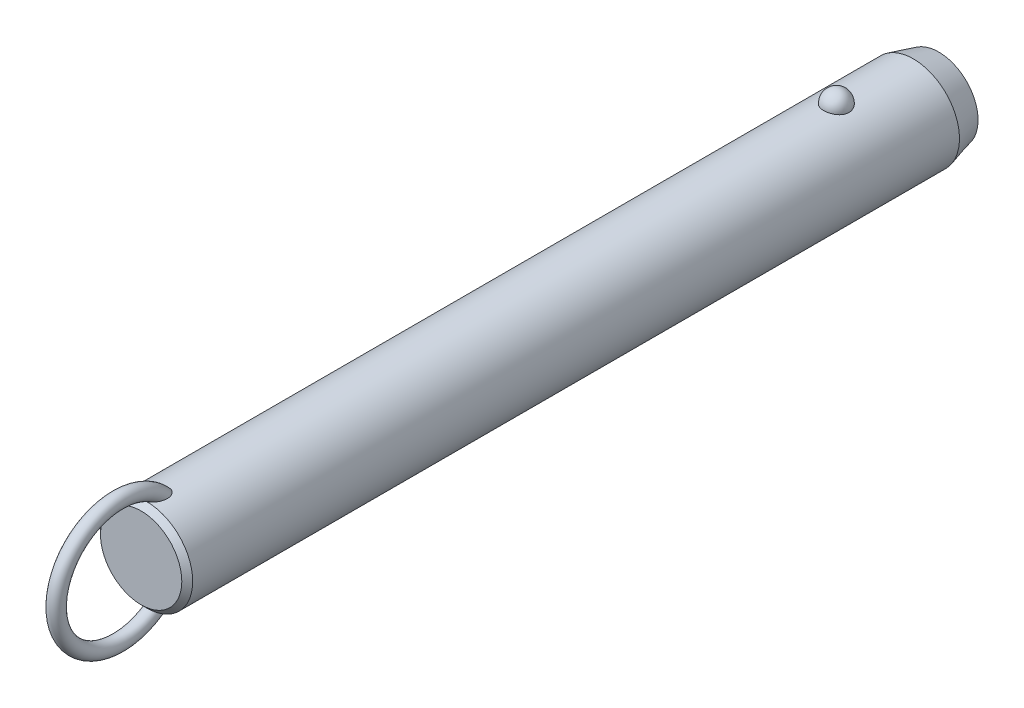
ISO-10303-21;
HEADER;
FILE_DESCRIPTION(('STEP AP214'),'2;1');
FILE_NAME('part.step','',(''),(''),'','','');
FILE_SCHEMA(('AUTOMOTIVE_DESIGN { 1 0 10303 214 1 1 1 1 }'));
ENDSEC;
DATA;
#1=APPLICATION_CONTEXT('core data for automotive mechanical design processes');
#2=APPLICATION_PROTOCOL_DEFINITION('international standard','automotive_design',2000,#1);
#3=PRODUCT_CONTEXT('',#1,'mechanical');
#4=PRODUCT('Part','Part','',(#3));
#5=PRODUCT_RELATED_PRODUCT_CATEGORY('part','',(#4));
#6=PRODUCT_DEFINITION_FORMATION('','',#4);
#7=PRODUCT_DEFINITION_CONTEXT('part definition',#1,'design');
#8=PRODUCT_DEFINITION('design','',#6,#7);
#9=PRODUCT_DEFINITION_SHAPE('','',#8);
#10=(LENGTH_UNIT() NAMED_UNIT(*) SI_UNIT(.MILLI.,.METRE.));
#11=(NAMED_UNIT(*) PLANE_ANGLE_UNIT() SI_UNIT($,.RADIAN.));
#12=(NAMED_UNIT(*) SI_UNIT($,.STERADIAN.) SOLID_ANGLE_UNIT());
#13=UNCERTAINTY_MEASURE_WITH_UNIT(LENGTH_MEASURE(1.E-05),#10,'distance_accuracy_value','');
#14=(GEOMETRIC_REPRESENTATION_CONTEXT(3) GLOBAL_UNCERTAINTY_ASSIGNED_CONTEXT((#13)) GLOBAL_UNIT_ASSIGNED_CONTEXT((#10,
#11,#12)) REPRESENTATION_CONTEXT('',''));
#15=CARTESIAN_POINT('',(0.,0.,0.));
#16=DIRECTION('',(0.,0.,1.));
#17=DIRECTION('',(1.,0.,0.));
#18=AXIS2_PLACEMENT_3D('',#15,#16,#17);
#19=CARTESIAN_POINT('',(0.,0.,175.3));
#20=DIRECTION('',(0.,0.,-1.));
#21=DIRECTION('',(-1.,0.,0.));
#22=AXIS2_PLACEMENT_3D('',#19,#20,#21);
#23=CYLINDRICAL_SURFACE('',#22,12.7);
#24=CARTESIAN_POINT('',(3.46661256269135,12.2177165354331,-3.50000000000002));
#25=CARTESIAN_POINT('',(3.4666090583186,12.2177194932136,-3.30432790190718));
#26=CARTESIAN_POINT('',(3.45063567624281,12.2222841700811,-3.10861112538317));
#27=CARTESIAN_POINT('',(3.38712451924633,12.2400345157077,-2.72271899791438));
#28=CARTESIAN_POINT('',(3.33957415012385,12.2532236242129,-2.53254588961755));
#29=CARTESIAN_POINT('',(3.2141234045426,12.286724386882,-2.16324948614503));
#30=CARTESIAN_POINT('',(3.13623639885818,12.3070329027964,-1.98412136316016));
#31=CARTESIAN_POINT('',(2.95205930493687,12.3525018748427,-1.6418059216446));
#32=CARTESIAN_POINT('',(2.84577003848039,12.3776621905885,-1.47861814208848));
#33=CARTESIAN_POINT('',(2.60688050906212,12.4301712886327,-1.17190583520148));
#34=CARTESIAN_POINT('',(2.47415697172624,12.4575299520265,-1.0284789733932));
#35=CARTESIAN_POINT('',(2.18615174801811,12.5112810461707,-0.766177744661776));
#36=CARTESIAN_POINT('',(2.03087002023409,12.5376734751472,-0.647303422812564));
#37=CARTESIAN_POINT('',(1.70237334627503,12.5864761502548,-0.437732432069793));
#38=CARTESIAN_POINT('',(1.52920948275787,12.6088972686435,-0.346958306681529));
#39=CARTESIAN_POINT('',(1.16944170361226,12.6473352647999,-0.195750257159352));
#40=CARTESIAN_POINT('',(0.982839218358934,12.663352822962,-0.135313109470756));
#41=CARTESIAN_POINT('',(0.604961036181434,12.6869706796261,-0.0473241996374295));
#42=CARTESIAN_POINT('',(0.41382314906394,12.6947125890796,-0.0192185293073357));
#43=CARTESIAN_POINT('',(0.0293827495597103,12.7014203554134,0.00517254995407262));
#44=CARTESIAN_POINT('',(-0.163919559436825,12.7003870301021,0.00146092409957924));
#45=CARTESIAN_POINT('',(-0.544374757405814,12.689735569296,-0.0373939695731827));
#46=CARTESIAN_POINT('',(-0.731575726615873,12.6802364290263,-0.0721015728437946));
#47=CARTESIAN_POINT('',(-1.09733277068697,12.6538333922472,-0.171364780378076));
#48=CARTESIAN_POINT('',(-1.27588869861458,12.6369293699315,-0.235920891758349));
#49=CARTESIAN_POINT('',(-1.6204698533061,12.5973946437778,-0.393548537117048));
#50=CARTESIAN_POINT('',(-1.78641865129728,12.5747321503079,-0.486778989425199));
#51=CARTESIAN_POINT('',(-2.10030671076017,12.5261316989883,-0.699110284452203));
#52=CARTESIAN_POINT('',(-2.24824419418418,12.5001934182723,-0.818213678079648));
#53=CARTESIAN_POINT('',(-2.52491489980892,12.4472906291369,-1.0815712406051));
#54=CARTESIAN_POINT('',(-2.65324222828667,12.4203160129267,-1.22624992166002));
#55=CARTESIAN_POINT('',(-2.88410007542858,12.3687509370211,-1.53528325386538));
#56=CARTESIAN_POINT('',(-2.98662883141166,12.3441606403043,-1.69963924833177));
#57=CARTESIAN_POINT('',(-3.16432417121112,12.2998199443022,-2.04548497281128));
#58=CARTESIAN_POINT('',(-3.23917525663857,12.2801261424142,-2.22714424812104));
#59=CARTESIAN_POINT('',(-3.35800573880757,12.248167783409,-2.60091389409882));
#60=CARTESIAN_POINT('',(-3.4019860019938,12.2359030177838,-2.79302397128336));
#61=CARTESIAN_POINT('',(-3.45784812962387,12.2202347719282,-3.18140279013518));
#62=CARTESIAN_POINT('',(-3.46986123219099,12.2167950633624,-3.37765118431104));
#63=CARTESIAN_POINT('',(-3.46186273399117,12.2190638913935,-3.76943689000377));
#64=CARTESIAN_POINT('',(-3.44185196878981,12.2247721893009,-3.96497421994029));
#65=CARTESIAN_POINT('',(-3.37048652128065,12.2446381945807,-4.34881728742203));
#66=CARTESIAN_POINT('',(-3.31928253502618,12.2587552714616,-4.53715319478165));
#67=CARTESIAN_POINT('',(-3.18693461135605,12.2938237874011,-4.9023172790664));
#68=CARTESIAN_POINT('',(-3.1057895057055,12.3147754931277,-5.07914500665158));
#69=CARTESIAN_POINT('',(-2.91506431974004,12.3613125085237,-5.41732059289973));
#70=CARTESIAN_POINT('',(-2.80533587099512,12.3869217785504,-5.57858147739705));
#71=CARTESIAN_POINT('',(-2.560414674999,12.4398525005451,-5.88013283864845));
#72=CARTESIAN_POINT('',(-2.42522099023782,12.4671740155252,-6.02042254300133));
#73=CARTESIAN_POINT('',(-2.1323357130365,12.5205965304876,-6.27662798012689));
#74=CARTESIAN_POINT('',(-1.97456596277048,12.5466928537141,-6.39245542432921));
#75=CARTESIAN_POINT('',(-1.64115839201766,12.5946384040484,-6.59583547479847));
#76=CARTESIAN_POINT('',(-1.46552179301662,12.6164879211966,-6.68339001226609));
#77=CARTESIAN_POINT('',(-1.10356050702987,12.6532533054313,-6.82682153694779));
#78=CARTESIAN_POINT('',(-0.9173913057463,12.6682500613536,-6.88306988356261));
#79=CARTESIAN_POINT('',(-0.537836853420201,12.6900288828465,-6.96386887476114));
#80=CARTESIAN_POINT('',(-0.344452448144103,12.6968119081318,-6.98842322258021));
#81=CARTESIAN_POINT('',(0.0402577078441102,12.7013667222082,-7.00496469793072));
#82=CARTESIAN_POINT('',(0.231556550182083,12.6993008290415,-6.99753844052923));
#83=CARTESIAN_POINT('',(0.610105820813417,12.6867505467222,-6.95166366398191));
#84=CARTESIAN_POINT('',(0.797356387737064,12.6762664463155,-6.91321620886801));
#85=CARTESIAN_POINT('',(1.16186657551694,12.6480587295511,-6.80658431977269));
#86=CARTESIAN_POINT('',(1.33915951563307,12.6303611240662,-6.73850666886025));
#87=CARTESIAN_POINT('',(1.67968518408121,12.5896027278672,-6.57450875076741));
#88=CARTESIAN_POINT('',(1.84291705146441,12.5665416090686,-6.47858678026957));
#89=CARTESIAN_POINT('',(2.15340192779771,12.5171072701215,-6.25982455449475));
#90=CARTESIAN_POINT('',(2.30037831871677,12.4906895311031,-6.13660186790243));
#91=CARTESIAN_POINT('',(2.5717412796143,12.4376567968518,-5.86739587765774));
#92=CARTESIAN_POINT('',(2.69612388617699,12.4110417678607,-5.72140858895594));
#93=CARTESIAN_POINT('',(2.92107785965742,12.360051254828,-5.40794137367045));
#94=CARTESIAN_POINT('',(3.02121329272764,12.3357209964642,-5.24014110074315));
#95=CARTESIAN_POINT('',(3.19236291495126,12.2925446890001,-4.88969865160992));
#96=CARTESIAN_POINT('',(3.26338839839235,12.2736965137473,-4.70706226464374));
#97=CARTESIAN_POINT('',(3.36788038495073,12.245404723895,-4.35469510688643));
#98=CARTESIAN_POINT('',(3.40484026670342,12.2351018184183,-4.18605935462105));
#99=CARTESIAN_POINT('',(3.45420764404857,12.2212564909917,-3.84496058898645));
#100=CARTESIAN_POINT('',(3.46661565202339,12.2177139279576,-3.67249765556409));
#101=CARTESIAN_POINT('',(3.46661256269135,12.2177165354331,-3.50000000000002));
#102=B_SPLINE_CURVE_WITH_KNOTS('',3,(#24,#25,#26,#27,#28,#29,#30,#31,#32,#33,#34,#35,#36,#37,
#38,#39,#40,#41,#42,#43,#44,#45,#46,#47,#48,#49,#50,#51,#52,#53,#54,#55,#56,#57,#58,#59,#60,#61,
#62,#63,#64,#65,#66,#67,#68,#69,#70,#71,#72,#73,#74,#75,#76,#77,#78,#79,#80,#81,#82,#83,#84,#85,
#86,#87,#88,#89,#90,#91,#92,#93,#94,#95,#96,#97,#98,#99,#100,#101),.UNSPECIFIED.,.T.,.F.,(4,2,2,
2,2,2,2,2,2,2,2,2,2,2,2,2,2,2,2,2,2,2,2,2,2,2,2,2,2,2,2,2,2,2,2,2,2,2,4),(0.,0.586396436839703,
1.17302689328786,1.7593990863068,2.34575431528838,2.93491084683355,3.52406845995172,
4.11158733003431,4.69904375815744,5.2762784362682,5.85345931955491,6.42265312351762,
6.99185659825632,7.56427334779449,8.136746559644,8.71981013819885,9.3029135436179,
9.89247258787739,10.4820150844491,11.0691335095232,11.6562366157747,12.2405256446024,
12.8248374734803,13.412244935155,13.9996740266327,14.5891883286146,15.1786623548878,
15.7609861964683,16.3432419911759,16.9148635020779,17.4864654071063,18.0560241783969,
18.6256177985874,19.2037609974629,19.7820055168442,20.3699810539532,20.957728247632,
21.4746855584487,21.9916320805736),.UNSPECIFIED.);
#103=CARTESIAN_POINT('',(3.46661256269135,12.2177165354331,-3.50000000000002));
#104=VERTEX_POINT('',#103);
#105=EDGE_CURVE('E41',#104,#104,#102,.T.);
#106=ORIENTED_EDGE('',*,*,#105,.T.);
#107=EDGE_LOOP('',(#106));
#108=FACE_BOUND('',#107,.T.);
#109=CARTESIAN_POINT('',(0.,0.,186.5));
#110=DIRECTION('',(0.,0.,1.));
#111=DIRECTION('',(1.,0.,0.));
#112=AXIS2_PLACEMENT_3D('',#109,#110,#111);
#113=CIRCLE('',#112,12.7);
#114=CARTESIAN_POINT('',(12.7,0.,186.5));
#115=VERTEX_POINT('',#114);
#116=EDGE_CURVE('E10',#115,#115,#113,.F.);
#117=ORIENTED_EDGE('',*,*,#116,.T.);
#118=EDGE_LOOP('',(#117));
#119=FACE_BOUND('',#118,.T.);
#120=CARTESIAN_POINT('',(-0.548122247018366,-12.6881662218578,180.243218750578));
#121=CARTESIAN_POINT('',(-0.648865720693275,-12.6838128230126,180.277926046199));
#122=CARTESIAN_POINT('',(-0.746398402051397,-12.6783867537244,180.322042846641));
#123=CARTESIAN_POINT('',(-0.932125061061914,-12.666091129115,180.426764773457));
#124=CARTESIAN_POINT('',(-1.02030388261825,-12.6592192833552,180.487396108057));
#125=CARTESIAN_POINT('',(-1.18487740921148,-12.6448747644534,180.621847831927));
#126=CARTESIAN_POINT('',(-1.26134296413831,-12.637406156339,180.695582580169));
#127=CARTESIAN_POINT('',(-1.4023120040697,-12.6225412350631,180.853604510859));
#128=CARTESIAN_POINT('',(-1.466814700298,-12.6151449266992,180.93789238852));
#129=CARTESIAN_POINT('',(-1.60714786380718,-12.5981718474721,181.149657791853));
#130=CARTESIAN_POINT('',(-1.67725126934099,-12.588900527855,181.280962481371));
#131=CARTESIAN_POINT('',(-1.79536591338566,-12.5725964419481,181.553247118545));
#132=CARTESIAN_POINT('',(-1.84333535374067,-12.5655679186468,181.694244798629));
#133=CARTESIAN_POINT('',(-1.93422576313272,-12.5519624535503,182.037645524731));
#134=CARTESIAN_POINT('',(-1.96788773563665,-12.5466298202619,182.242557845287));
#135=CARTESIAN_POINT('',(-1.9941399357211,-12.542463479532,182.551760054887));
#136=CARTESIAN_POINT('',(-1.99883864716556,-12.5417153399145,182.655298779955));
#137=CARTESIAN_POINT('',(-2.00078003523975,-12.5414074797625,182.86245124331));
#138=CARTESIAN_POINT('',(-1.99802449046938,-12.5418474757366,182.966064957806));
#139=CARTESIAN_POINT('',(-1.98336733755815,-12.5441750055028,183.21032076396));
#140=CARTESIAN_POINT('',(-1.96851430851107,-12.5465291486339,183.350780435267));
#141=CARTESIAN_POINT('',(-1.92707089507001,-12.5529612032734,183.629960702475));
#142=CARTESIAN_POINT('',(-1.90047458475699,-12.5570399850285,183.768680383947));
#143=CARTESIAN_POINT('',(-1.8361912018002,-12.5666008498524,184.04341135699));
#144=CARTESIAN_POINT('',(-1.79850828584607,-12.57208240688,184.179423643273));
#145=CARTESIAN_POINT('',(-1.71223796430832,-12.5841228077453,184.447842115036));
#146=CARTESIAN_POINT('',(-1.66365679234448,-12.5906810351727,184.580250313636));
#147=CARTESIAN_POINT('',(-1.5780450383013,-12.6016176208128,184.78548877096));
#148=CARTESIAN_POINT('',(-1.54477252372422,-12.6057501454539,184.859914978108));
#149=CARTESIAN_POINT('',(-1.47424480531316,-12.6141930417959,185.006839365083));
#150=CARTESIAN_POINT('',(-1.436990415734,-12.6185033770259,185.079337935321));
#151=CARTESIAN_POINT('',(-1.35825795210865,-12.6272207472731,185.221892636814));
#152=CARTESIAN_POINT('',(-1.31678520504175,-12.6316276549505,185.291951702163));
#153=CARTESIAN_POINT('',(-1.22917793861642,-12.6404532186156,185.429070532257));
#154=CARTESIAN_POINT('',(-1.18304514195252,-12.6448718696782,185.496131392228));
#155=CARTESIAN_POINT('',(-1.0724641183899,-12.6547893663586,185.643874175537));
#156=CARTESIAN_POINT('',(-1.0064223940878,-12.6602600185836,185.723384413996));
#157=CARTESIAN_POINT('',(-0.864441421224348,-12.6707460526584,185.873169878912));
#158=CARTESIAN_POINT('',(-0.788516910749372,-12.6757620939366,185.943458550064));
#159=CARTESIAN_POINT('',(-0.652215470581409,-12.6833591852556,186.048680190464));
#160=CARTESIAN_POINT('',(-0.59498203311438,-12.6861973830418,186.087624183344));
#161=CARTESIAN_POINT('',(-0.475269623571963,-12.6912445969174,186.156489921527));
#162=CARTESIAN_POINT('',(-0.412800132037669,-12.6934547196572,186.186427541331));
#163=CARTESIAN_POINT('',(-0.295749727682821,-12.6966636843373,186.229756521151));
#164=CARTESIAN_POINT('',(-0.241949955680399,-12.6978134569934,186.245218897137));
#165=CARTESIAN_POINT('',(-0.132508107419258,-12.6994261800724,186.266884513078));
#166=CARTESIAN_POINT('',(-0.0768679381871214,-12.6998898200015,186.273097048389));
#167=CARTESIAN_POINT('',(0.0347696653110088,-12.7000752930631,186.275583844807));
#168=CARTESIAN_POINT('',(0.0907676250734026,-12.6997954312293,186.271835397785));
#169=CARTESIAN_POINT('',(0.201283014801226,-12.6985255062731,186.254788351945));
#170=CARTESIAN_POINT('',(0.255799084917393,-12.6975348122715,186.241481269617));
#171=CARTESIAN_POINT('',(0.376042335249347,-12.6946091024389,186.20203792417));
#172=CARTESIAN_POINT('',(0.440950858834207,-12.6924943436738,186.173449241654));
#173=CARTESIAN_POINT('',(0.56535027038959,-12.6875639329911,186.106323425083));
#174=CARTESIAN_POINT('',(0.624828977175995,-12.6847467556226,186.067764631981));
#175=CARTESIAN_POINT('',(0.774116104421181,-12.6767252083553,185.956949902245));
#176=CARTESIAN_POINT('',(0.859449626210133,-12.6711344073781,185.878760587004));
#177=CARTESIAN_POINT('',(1.01789440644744,-12.6593922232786,185.710943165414));
#178=CARTESIAN_POINT('',(1.09096902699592,-12.653239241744,185.621282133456));
#179=CARTESIAN_POINT('',(1.22268793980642,-12.6411674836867,185.440265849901));
#180=CARTESIAN_POINT('',(1.28193986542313,-12.6352572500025,185.349345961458));
#181=CARTESIAN_POINT('',(1.39259777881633,-12.6235401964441,185.162792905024));
#182=CARTESIAN_POINT('',(1.44399707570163,-12.6177334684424,185.067155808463));
#183=CARTESIAN_POINT('',(1.53972870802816,-12.6064093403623,184.872273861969));
#184=CARTESIAN_POINT('',(1.58405262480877,-12.6008922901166,184.773024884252));
#185=CARTESIAN_POINT('',(1.66600705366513,-12.5903187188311,184.571772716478));
#186=CARTESIAN_POINT('',(1.70363651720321,-12.5852622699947,184.469769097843));
#187=CARTESIAN_POINT('',(1.77545379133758,-12.5753406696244,184.254358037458));
#188=CARTESIAN_POINT('',(1.80903453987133,-12.5705328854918,184.140745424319));
#189=CARTESIAN_POINT('',(1.86844163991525,-12.5618400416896,183.911457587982));
#190=CARTESIAN_POINT('',(1.89426665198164,-12.5579551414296,183.795782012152));
#191=CARTESIAN_POINT('',(1.9378546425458,-12.5513030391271,183.563007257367));
#192=CARTESIAN_POINT('',(1.95562640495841,-12.5485346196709,183.445909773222));
#193=CARTESIAN_POINT('',(1.98264463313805,-12.5442934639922,183.210747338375));
#194=CARTESIAN_POINT('',(1.99189298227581,-12.5428204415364,183.09268260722));
#195=CARTESIAN_POINT('',(2.00416068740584,-12.540871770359,182.780622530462));
#196=CARTESIAN_POINT('',(1.99944433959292,-12.541631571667,182.586229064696));
#197=CARTESIAN_POINT('',(1.96113755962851,-12.5476846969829,182.200309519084));
#198=CARTESIAN_POINT('',(1.92758341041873,-12.5529723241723,182.008780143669));
#199=CARTESIAN_POINT('',(1.83934342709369,-12.5661532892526,181.682272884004));
#200=CARTESIAN_POINT('',(1.79215440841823,-12.5730485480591,181.54524997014));
#201=CARTESIAN_POINT('',(1.67676242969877,-12.588958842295,181.280445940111));
#202=CARTESIAN_POINT('',(1.60859050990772,-12.597970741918,181.152651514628));
#203=CARTESIAN_POINT('',(1.46583832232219,-12.6152829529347,180.935800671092));
#204=CARTESIAN_POINT('',(1.39525727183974,-12.6233659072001,180.84410500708));
#205=CARTESIAN_POINT('',(1.23992594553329,-12.6395676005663,180.673485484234));
#206=CARTESIAN_POINT('',(1.15517932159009,-12.6476863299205,180.594558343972));
#207=CARTESIAN_POINT('',(0.971995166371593,-12.6630846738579,180.452643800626));
#208=CARTESIAN_POINT('',(0.873456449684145,-12.6703572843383,180.389784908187));
#209=CARTESIAN_POINT('',(0.665847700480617,-12.6829569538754,180.284487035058));
#210=CARTESIAN_POINT('',(0.556784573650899,-12.688285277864,180.242034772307));
#211=CARTESIAN_POINT('',(0.347338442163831,-12.6956226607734,180.184443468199));
#212=CARTESIAN_POINT('',(0.247759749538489,-12.6979816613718,180.166399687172));
#213=CARTESIAN_POINT('',(0.0470218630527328,-12.7003077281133,180.148600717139));
#214=CARTESIAN_POINT('',(-0.0541350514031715,-12.7002779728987,180.148821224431));
#215=CARTESIAN_POINT('',(-0.221414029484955,-12.6982482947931,180.164363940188));
#216=CARTESIAN_POINT('',(-0.288055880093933,-12.6969033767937,180.174666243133));
#217=CARTESIAN_POINT('',(-0.419599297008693,-12.6932369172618,180.20313489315));
#218=CARTESIAN_POINT('',(-0.484501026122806,-12.6909154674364,180.221300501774));
#219=CARTESIAN_POINT('',(-0.548122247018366,-12.6881662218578,180.243218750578));
#220=B_SPLINE_CURVE_WITH_KNOTS('',3,(#120,#121,#122,#123,#124,#125,#126,#127,#128,#129,#130,
#131,#132,#133,#134,#135,#136,#137,#138,#139,#140,#141,#142,#143,#144,#145,#146,#147,#148,#149,
#150,#151,#152,#153,#154,#155,#156,#157,#158,#159,#160,#161,#162,#163,#164,#165,#166,#167,#168,
#169,#170,#171,#172,#173,#174,#175,#176,#177,#178,#179,#180,#181,#182,#183,#184,#185,#186,#187,
#188,#189,#190,#191,#192,#193,#194,#195,#196,#197,#198,#199,#200,#201,#202,#203,#204,#205,#206,
#207,#208,#209,#210,#211,#212,#213,#214,#215,#216,#217,#218,#219),.UNSPECIFIED.,.T.,.F.,(4,2,2,
2,2,2,2,2,2,2,2,2,2,2,2,2,2,2,2,2,2,2,2,2,2,2,2,2,2,2,2,2,2,2,2,2,2,2,2,2,2,2,2,2,2,2,2,2,2,4),
(0.,0.31964225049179,0.639794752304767,0.957927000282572,1.27608021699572,1.72100165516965,
2.16675988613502,2.78630021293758,3.09705782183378,3.40774128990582,3.83096358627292,
4.25439969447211,4.67767724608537,5.10071330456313,5.34550297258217,5.59024267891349,
5.83467707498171,6.07902143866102,6.38891080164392,6.69834321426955,6.9056091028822,
7.11250749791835,7.27977315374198,7.44687060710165,7.61434932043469,7.78197685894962,
7.99365544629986,8.20579780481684,8.55147335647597,8.89816429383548,9.22375138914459,
9.54961437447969,9.8758622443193,10.202161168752,10.557587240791,10.9130746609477,
11.2681734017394,11.6231936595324,12.2046601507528,12.7853961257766,13.219164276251,
13.6522938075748,13.9989174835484,14.3454519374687,14.6946768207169,15.0436740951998,
15.3457513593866,15.6474266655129,15.8493051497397,16.0511646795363),.UNSPECIFIED.);
#221=CARTESIAN_POINT('',(-0.548122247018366,-12.6881662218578,180.243218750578));
#222=VERTEX_POINT('',#221);
#223=EDGE_CURVE('E59',#222,#222,#220,.T.);
#224=ORIENTED_EDGE('',*,*,#223,.T.);
#225=EDGE_LOOP('',(#224));
#226=FACE_BOUND('',#225,.T.);
#227=CARTESIAN_POINT('',(-0.548122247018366,12.6881662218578,180.243218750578));
#228=CARTESIAN_POINT('',(-0.459436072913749,12.6919968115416,180.212673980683));
#229=CARTESIAN_POINT('',(-0.368189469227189,12.6949996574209,180.189391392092));
#230=CARTESIAN_POINT('',(-0.18302400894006,12.6990186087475,180.158406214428));
#231=CARTESIAN_POINT('',(-0.0891049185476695,12.7000345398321,180.150704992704));
#232=CARTESIAN_POINT('',(0.0987147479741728,12.6999636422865,180.151245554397));
#233=CARTESIAN_POINT('',(0.192615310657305,12.6988761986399,180.159492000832));
#234=CARTESIAN_POINT('',(0.377658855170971,12.6947211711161,180.191551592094));
#235=CARTESIAN_POINT('',(0.468801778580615,12.6916535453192,180.215365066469));
#236=CARTESIAN_POINT('',(0.645809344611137,12.6838788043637,180.27745651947));
#237=CARTESIAN_POINT('',(0.731679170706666,12.6791733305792,180.315720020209));
#238=CARTESIAN_POINT('',(0.896315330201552,12.6686004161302,180.405120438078));
#239=CARTESIAN_POINT('',(0.975080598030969,12.6627328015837,180.456259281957));
#240=CARTESIAN_POINT('',(1.12963655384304,12.6499161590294,180.57367820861));
#241=CARTESIAN_POINT('',(1.20478673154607,12.6429194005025,180.640792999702));
#242=CARTESIAN_POINT('',(1.34448241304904,12.6288282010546,180.78522507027));
#243=CARTESIAN_POINT('',(1.40902173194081,12.621733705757,180.862548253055));
#244=CARTESIAN_POINT('',(1.55208211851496,12.6050877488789,181.059247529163));
#245=CARTESIAN_POINT('',(1.62510490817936,12.5957546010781,181.182654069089));
#246=CARTESIAN_POINT('',(1.75019044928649,12.5789823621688,181.439769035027));
#247=CARTESIAN_POINT('',(1.8022137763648,12.5715468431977,181.573496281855));
#248=CARTESIAN_POINT('',(1.90309965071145,12.5567434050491,181.898351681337));
#249=CARTESIAN_POINT('',(1.94342317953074,12.5504515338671,182.092161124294));
#250=CARTESIAN_POINT('',(1.99332997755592,12.5426147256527,182.48378810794));
#251=CARTESIAN_POINT('',(2.00285305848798,12.5410790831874,182.681612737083));
#252=CARTESIAN_POINT('',(1.99678999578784,12.5420407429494,183.016642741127));
#253=CARTESIAN_POINT('',(1.98794117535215,12.5434564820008,183.154042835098));
#254=CARTESIAN_POINT('',(1.95865119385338,12.5480641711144,183.427639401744));
#255=CARTESIAN_POINT('',(1.93820436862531,12.5512569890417,183.563835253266));
#256=CARTESIAN_POINT('',(1.88647896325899,12.5591352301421,183.834249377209));
#257=CARTESIAN_POINT('',(1.85518800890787,12.5638223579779,183.968465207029));
#258=CARTESIAN_POINT('',(1.78217886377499,12.5743868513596,184.233936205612));
#259=CARTESIAN_POINT('',(1.74046509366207,12.5802637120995,184.365192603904));
#260=CARTESIAN_POINT('',(1.66024095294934,12.5910571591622,184.586085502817));
#261=CARTESIAN_POINT('',(1.62434772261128,12.5957535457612,184.676690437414));
#262=CARTESIAN_POINT('',(1.54709009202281,12.6054762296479,184.855512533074));
#263=CARTESIAN_POINT('',(1.50572681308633,12.6105024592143,184.943730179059));
#264=CARTESIAN_POINT('',(1.41728020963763,12.620748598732,185.116932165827));
#265=CARTESIAN_POINT('',(1.37021377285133,12.625967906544,185.201925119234));
#266=CARTESIAN_POINT('',(1.26969620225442,12.6364721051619,185.368007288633));
#267=CARTESIAN_POINT('',(1.21624929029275,12.6417569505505,185.449099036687));
#268=CARTESIAN_POINT('',(1.10304413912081,12.6521331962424,185.604702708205));
#269=CARTESIAN_POINT('',(1.04340936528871,12.657226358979,185.679303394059));
#270=CARTESIAN_POINT('',(0.915919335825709,12.667090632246,185.821324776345));
#271=CARTESIAN_POINT('',(0.848064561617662,12.6718617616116,185.88874589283));
#272=CARTESIAN_POINT('',(0.717035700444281,12.67987711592,186.000624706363));
#273=CARTESIAN_POINT('',(0.655526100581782,12.6832377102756,186.046997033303));
#274=CARTESIAN_POINT('',(0.525985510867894,12.6892676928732,186.129619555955));
#275=CARTESIAN_POINT('',(0.457969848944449,12.6919386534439,186.165892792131));
#276=CARTESIAN_POINT('',(0.334859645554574,12.695691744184,186.216657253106));
#277=CARTESIAN_POINT('',(0.281116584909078,12.6970073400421,186.234373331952));
#278=CARTESIAN_POINT('',(0.171425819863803,12.6989609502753,186.260642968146));
#279=CARTESIAN_POINT('',(0.115480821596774,12.699599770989,186.269207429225));
#280=CARTESIAN_POINT('',(0.00272618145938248,12.7001251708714,186.276253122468));
#281=CARTESIAN_POINT('',(-0.054085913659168,12.7000089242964,186.274696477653));
#282=CARTESIAN_POINT('',(-0.166544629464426,12.6990328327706,186.261600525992));
#283=CARTESIAN_POINT('',(-0.222190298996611,12.6981724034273,186.250053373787));
#284=CARTESIAN_POINT('',(-0.342018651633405,12.695562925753,186.214912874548));
#285=CARTESIAN_POINT('',(-0.405606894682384,12.6936676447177,186.18933225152));
#286=CARTESIAN_POINT('',(-0.527815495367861,12.6891754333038,186.128311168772));
#287=CARTESIAN_POINT('',(-0.586425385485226,12.6865770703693,186.092850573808));
#288=CARTESIAN_POINT('',(-0.731842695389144,12.6792129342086,185.991496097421));
#289=CARTESIAN_POINT('',(-0.81470941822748,12.6740767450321,185.9200395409));
#290=CARTESIAN_POINT('',(-0.969101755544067,12.6632083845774,185.76589007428));
#291=CARTESIAN_POINT('',(-1.04059564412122,12.6574746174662,185.683166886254));
#292=CARTESIAN_POINT('',(-1.16981116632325,12.6461638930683,185.515809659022));
#293=CARTESIAN_POINT('',(-1.22811369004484,12.6405994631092,185.431616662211));
#294=CARTESIAN_POINT('',(-1.33743405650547,12.6295007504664,185.258579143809));
#295=CARTESIAN_POINT('',(-1.38844577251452,12.6239664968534,185.169730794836));
#296=CARTESIAN_POINT('',(-1.48400702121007,12.6130898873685,184.988389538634));
#297=CARTESIAN_POINT('',(-1.52854232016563,12.6077479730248,184.895889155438));
#298=CARTESIAN_POINT('',(-1.61150113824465,12.5974127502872,184.708160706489));
#299=CARTESIAN_POINT('',(-1.64992317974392,12.5924195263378,184.612931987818));
#300=CARTESIAN_POINT('',(-1.73468589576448,12.581070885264,184.38289362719));
#301=CARTESIAN_POINT('',(-1.77831261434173,12.5749388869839,184.247066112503));
#302=CARTESIAN_POINT('',(-1.85439734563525,12.5639437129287,183.972212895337));
#303=CARTESIAN_POINT('',(-1.88684994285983,12.5590811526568,183.833185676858));
#304=CARTESIAN_POINT('',(-1.94008483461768,12.550968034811,183.55309235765));
#305=CARTESIAN_POINT('',(-1.96088706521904,12.5477147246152,183.412030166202));
#306=CARTESIAN_POINT('',(-1.99000539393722,12.5431291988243,183.128668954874));
#307=CARTESIAN_POINT('',(-1.99832911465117,12.5417958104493,182.986370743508));
#308=CARTESIAN_POINT('',(-2.00166624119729,12.5412674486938,182.657627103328));
#309=CARTESIAN_POINT('',(-1.99178843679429,12.5428579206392,182.471088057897));
#310=CARTESIAN_POINT('',(-1.94455183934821,12.5502731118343,182.10162404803));
#311=CARTESIAN_POINT('',(-1.90724032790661,12.5560905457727,181.918693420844));
#312=CARTESIAN_POINT('',(-1.81330718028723,12.5699462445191,181.604848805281));
#313=CARTESIAN_POINT('',(-1.76338820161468,12.5771273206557,181.471910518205));
#314=CARTESIAN_POINT('',(-1.64305018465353,12.593414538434,181.215681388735));
#315=CARTESIAN_POINT('',(-1.57265346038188,12.6025185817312,181.092380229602));
#316=CARTESIAN_POINT('',(-1.42634956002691,12.6198178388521,180.883564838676));
#317=CARTESIAN_POINT('',(-1.35423772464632,12.6278405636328,180.795384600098));
#318=CARTESIAN_POINT('',(-1.19645664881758,12.6437632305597,180.632107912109));
#319=CARTESIAN_POINT('',(-1.1108053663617,12.6516633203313,180.556994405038));
#320=CARTESIAN_POINT('',(-0.947219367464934,12.6648319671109,180.437811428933));
#321=CARTESIAN_POINT('',(-0.871624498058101,12.670300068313,180.390541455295));
#322=CARTESIAN_POINT('',(-0.714161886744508,12.6801492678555,180.3077413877));
#323=CARTESIAN_POINT('',(-0.632295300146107,12.684530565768,180.27220913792));
#324=CARTESIAN_POINT('',(-0.548122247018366,12.6881662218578,180.243218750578));
#325=B_SPLINE_CURVE_WITH_KNOTS('',3,(#227,#228,#229,#230,#231,#232,#233,#234,#235,#236,#237,
#238,#239,#240,#241,#242,#243,#244,#245,#246,#247,#248,#249,#250,#251,#252,#253,#254,#255,#256,
#257,#258,#259,#260,#261,#262,#263,#264,#265,#266,#267,#268,#269,#270,#271,#272,#273,#274,#275,
#276,#277,#278,#279,#280,#281,#282,#283,#284,#285,#286,#287,#288,#289,#290,#291,#292,#293,#294,
#295,#296,#297,#298,#299,#300,#301,#302,#303,#304,#305,#306,#307,#308,#309,#310,#311,#312,#313,
#314,#315,#316,#317,#318,#319,#320,#321,#322,#323,#324),.UNSPECIFIED.,.T.,.F.,(4,2,2,2,2,2,2,2,
2,2,2,2,2,2,2,2,2,2,2,2,2,2,2,2,2,2,2,2,2,2,2,2,2,2,2,2,2,2,2,2,2,2,2,2,2,2,2,2,4),(0.,
0.281328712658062,0.562682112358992,0.844117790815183,1.12555942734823,1.40671982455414,
1.68792232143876,1.98972294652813,2.29169886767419,2.72039860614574,3.14989948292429,
3.74084916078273,4.33295293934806,4.74554109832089,5.15833092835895,5.57159335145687,
5.98468079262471,6.27722775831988,6.56971484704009,6.86135609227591,7.15280542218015,
7.43927407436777,7.72572595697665,7.95635862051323,8.18646071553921,8.35559393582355,
8.52452541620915,8.69408946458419,8.86378678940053,9.06834348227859,9.27332014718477,
9.60010414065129,9.92778432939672,10.2350252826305,10.5425229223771,10.8506864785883,
11.15892440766,11.5867893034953,12.0148612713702,12.4421984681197,12.8692745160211,
13.4279365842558,13.9856380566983,14.4107062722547,14.835313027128,15.1765567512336,
15.517351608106,15.7844129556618,16.051425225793),.UNSPECIFIED.);
#326=CARTESIAN_POINT('',(-0.548122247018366,12.6881662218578,180.243218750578));
#327=VERTEX_POINT('',#326);
#328=EDGE_CURVE('E66',#327,#327,#325,.T.);
#329=ORIENTED_EDGE('',*,*,#328,.T.);
#330=EDGE_LOOP('',(#329));
#331=FACE_BOUND('',#330,.T.);
#332=CARTESIAN_POINT('',(0.,0.,-24.6999999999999));
#333=DIRECTION('',(0.,0.,-1.));
#334=DIRECTION('',(-1.,0.,0.));
#335=AXIS2_PLACEMENT_3D('',#332,#333,#334);
#336=CIRCLE('',#335,12.7);
#337=CARTESIAN_POINT('',(-12.7,0.,-24.6999999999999));
#338=VERTEX_POINT('',#337);
#339=EDGE_CURVE('E56',#338,#338,#336,.F.);
#340=ORIENTED_EDGE('',*,*,#339,.T.);
#341=EDGE_LOOP('',(#340));
#342=FACE_BOUND('',#341,.T.);
#343=ADVANCED_FACE('F37',(#108,#119,#226,#331,#342),#23,.T.);
#344=CARTESIAN_POINT('',(0.,0.,-31.7));
#345=DIRECTION('',(0.,0.,-1.));
#346=DIRECTION('',(-1.,0.,0.));
#347=AXIS2_PLACEMENT_3D('',#344,#345,#346);
#348=PLANE('',#347);
#349=CARTESIAN_POINT('',(0.,0.,-31.7));
#350=DIRECTION('',(0.,0.,-1.));
#351=DIRECTION('',(-1.,0.,0.));
#352=AXIS2_PLACEMENT_3D('',#349,#350,#351);
#353=CIRCLE('',#352,10.8243556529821);
#354=CARTESIAN_POINT('',(-10.8243556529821,0.,-31.7));
#355=VERTEX_POINT('',#354);
#356=EDGE_CURVE('E65',#355,#355,#353,.T.);
#357=ORIENTED_EDGE('',*,*,#356,.T.);
#358=EDGE_LOOP('',(#357));
#359=FACE_BOUND('',#358,.T.);
#360=ADVANCED_FACE('F84',(#359),#348,.T.);
#361=CARTESIAN_POINT('',(0.,0.,-31.7));
#362=DIRECTION('',(0.,0.,1.));
#363=DIRECTION('',(1.,0.,0.));
#364=AXIS2_PLACEMENT_3D('',#361,#362,#363);
#365=CONICAL_SURFACE('',#364,10.8243556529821,0.261799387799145);
#366=ORIENTED_EDGE('',*,*,#339,.F.);
#367=EDGE_LOOP('',(#366));
#368=FACE_BOUND('',#367,.T.);
#369=ORIENTED_EDGE('',*,*,#356,.F.);
#370=EDGE_LOOP('',(#369));
#371=FACE_BOUND('',#370,.T.);
#372=ADVANCED_FACE('F82',(#368,#371),#365,.T.);
#373=CARTESIAN_POINT('',(0.,0.,188.));
#374=DIRECTION('',(0.,0.,1.));
#375=DIRECTION('',(1.,0.,0.));
#376=AXIS2_PLACEMENT_3D('',#373,#374,#375);
#377=PLANE('',#376);
#378=CARTESIAN_POINT('',(0.,0.,188.));
#379=DIRECTION('',(0.,0.,1.));
#380=DIRECTION('',(1.,0.,0.));
#381=AXIS2_PLACEMENT_3D('',#378,#379,#380);
#382=CIRCLE('',#381,11.2);
#383=CARTESIAN_POINT('',(11.2,0.,188.));
#384=VERTEX_POINT('',#383);
#385=EDGE_CURVE('E50',#384,#384,#382,.T.);
#386=ORIENTED_EDGE('',*,*,#385,.T.);
#387=EDGE_LOOP('',(#386));
#388=FACE_BOUND('',#387,.T.);
#389=ADVANCED_FACE('F76',(#388),#377,.T.);
#390=CARTESIAN_POINT('',(0.,0.,194.35));
#391=DIRECTION('',(1.,0.,0.));
#392=DIRECTION('',(0.,0.,-1.));
#393=AXIS2_PLACEMENT_3D('',#390,#391,#392);
#394=TOROIDAL_SURFACE('',#393,17.05,2.);
#395=ORIENTED_EDGE('',*,*,#328,.F.);
#396=EDGE_LOOP('',(#395));
#397=FACE_BOUND('',#396,.T.);
#398=ORIENTED_EDGE('',*,*,#223,.F.);
#399=EDGE_LOOP('',(#398));
#400=FACE_BOUND('',#399,.T.);
#401=ADVANCED_FACE('F72',(#397,#400),#394,.T.);
#402=CARTESIAN_POINT('',(0.,0.,188.));
#403=DIRECTION('',(0.,0.,-1.));
#404=DIRECTION('',(-1.,0.,0.));
#405=AXIS2_PLACEMENT_3D('',#402,#403,#404);
#406=CONICAL_SURFACE('',#405,11.2,0.785398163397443);
#407=ORIENTED_EDGE('',*,*,#116,.F.);
#408=EDGE_LOOP('',(#407));
#409=FACE_BOUND('',#408,.T.);
#410=ORIENTED_EDGE('',*,*,#385,.F.);
#411=EDGE_LOOP('',(#410));
#412=FACE_BOUND('',#411,.T.);
#413=ADVANCED_FACE('F39',(#409,#412),#406,.T.);
#414=CARTESIAN_POINT('',(0.,12.7,-3.50000000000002));
#415=DIRECTION('',(0.,1.,0.));
#416=DIRECTION('',(0.,0.,-1.));
#417=AXIS2_PLACEMENT_3D('',#414,#415,#416);
#418=SPHERICAL_SURFACE('',#417,3.5);
#419=ORIENTED_EDGE('',*,*,#105,.F.);
#420=EDGE_LOOP('',(#419));
#421=FACE_BOUND('',#420,.T.);
#422=ADVANCED_FACE('F78',(#421),#418,.T.);
#423=CLOSED_SHELL('',(#343,#360,#372,#389,#401,#413,#422));
#424=MANIFOLD_SOLID_BREP('B2',#423);
#425=ADVANCED_BREP_SHAPE_REPRESENTATION('',(#18,#424),#14);
#426=SHAPE_DEFINITION_REPRESENTATION(#9,#425);
ENDSEC;
END-ISO-10303-21;
